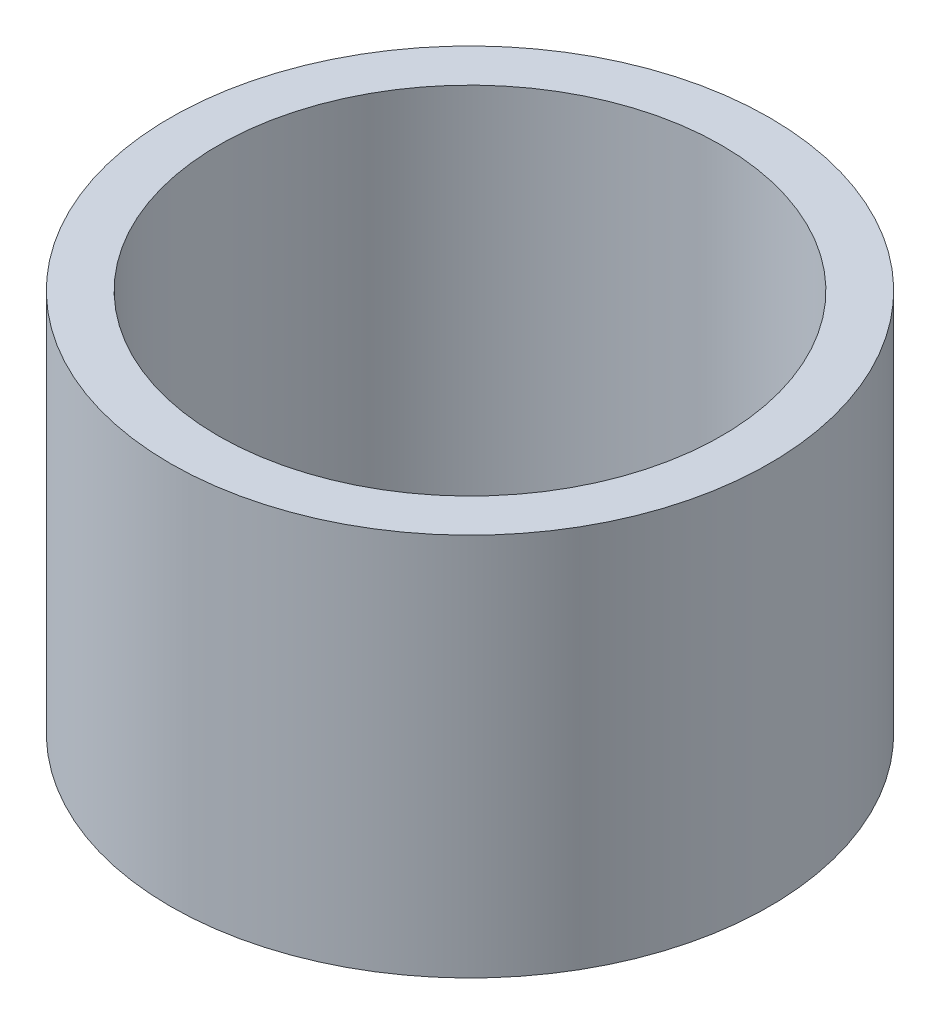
ISO-10303-21;
HEADER;
FILE_DESCRIPTION(('STEP AP214'),'2;1');
FILE_NAME('part.step','',(''),(''),'','','');
FILE_SCHEMA(('AUTOMOTIVE_DESIGN { 1 0 10303 214 1 1 1 1 }'));
ENDSEC;
DATA;
#1=APPLICATION_CONTEXT('core data for automotive mechanical design processes');
#2=APPLICATION_PROTOCOL_DEFINITION('international standard','automotive_design',2000,#1);
#3=PRODUCT_CONTEXT('',#1,'mechanical');
#4=PRODUCT('Part','Part','',(#3));
#5=PRODUCT_RELATED_PRODUCT_CATEGORY('part','',(#4));
#6=PRODUCT_DEFINITION_FORMATION('','',#4);
#7=PRODUCT_DEFINITION_CONTEXT('part definition',#1,'design');
#8=PRODUCT_DEFINITION('design','',#6,#7);
#9=PRODUCT_DEFINITION_SHAPE('','',#8);
#10=(LENGTH_UNIT() NAMED_UNIT(*) SI_UNIT(.MILLI.,.METRE.));
#11=(NAMED_UNIT(*) PLANE_ANGLE_UNIT() SI_UNIT($,.RADIAN.));
#12=(NAMED_UNIT(*) SI_UNIT($,.STERADIAN.) SOLID_ANGLE_UNIT());
#13=UNCERTAINTY_MEASURE_WITH_UNIT(LENGTH_MEASURE(1.E-05),#10,'distance_accuracy_value','');
#14=(GEOMETRIC_REPRESENTATION_CONTEXT(3) GLOBAL_UNCERTAINTY_ASSIGNED_CONTEXT((#13)) GLOBAL_UNIT_ASSIGNED_CONTEXT((#10,
#11,#12)) REPRESENTATION_CONTEXT('',''));
#15=CARTESIAN_POINT('',(0.,0.,0.));
#16=DIRECTION('',(0.,0.,1.));
#17=DIRECTION('',(1.,0.,0.));
#18=AXIS2_PLACEMENT_3D('',#15,#16,#17);
#19=CARTESIAN_POINT('',(0.,10.16,0.));
#20=DIRECTION('',(0.,1.,0.));
#21=DIRECTION('',(0.,0.,1.));
#22=AXIS2_PLACEMENT_3D('',#19,#20,#21);
#23=PLANE('',#22);
#24=CARTESIAN_POINT('',(0.,10.16,0.));
#25=DIRECTION('',(0.,1.,0.));
#26=DIRECTION('',(0.,0.,1.));
#27=AXIS2_PLACEMENT_3D('',#24,#25,#26);
#28=CIRCLE('',#27,7.9375);
#29=CARTESIAN_POINT('',(0.,10.16,7.9375));
#30=VERTEX_POINT('',#29);
#31=EDGE_CURVE('E10',#30,#30,#28,.T.);
#32=ORIENTED_EDGE('',*,*,#31,.T.);
#33=EDGE_LOOP('',(#32));
#34=FACE_BOUND('',#33,.T.);
#35=CARTESIAN_POINT('',(0.,10.16,0.));
#36=DIRECTION('',(0.,1.,0.));
#37=DIRECTION('',(0.,0.,1.));
#38=AXIS2_PLACEMENT_3D('',#35,#36,#37);
#39=CIRCLE('',#38,6.6675);
#40=CARTESIAN_POINT('',(0.,10.16,6.6675));
#41=VERTEX_POINT('',#40);
#42=EDGE_CURVE('E39',#41,#41,#39,.T.);
#43=ORIENTED_EDGE('',*,*,#42,.F.);
#44=EDGE_LOOP('',(#43));
#45=FACE_BOUND('',#44,.T.);
#46=ADVANCED_FACE('F28',(#34,#45),#23,.T.);
#47=CARTESIAN_POINT('',(0.,0.,0.));
#48=DIRECTION('',(0.,1.,0.));
#49=DIRECTION('',(0.,0.,1.));
#50=AXIS2_PLACEMENT_3D('',#47,#48,#49);
#51=PLANE('',#50);
#52=CARTESIAN_POINT('',(0.,0.,0.));
#53=DIRECTION('',(0.,1.,0.));
#54=DIRECTION('',(0.,0.,1.));
#55=AXIS2_PLACEMENT_3D('',#52,#53,#54);
#56=CIRCLE('',#55,7.9375);
#57=CARTESIAN_POINT('',(0.,0.,7.9375));
#58=VERTEX_POINT('',#57);
#59=EDGE_CURVE('E32',#58,#58,#56,.T.);
#60=ORIENTED_EDGE('',*,*,#59,.F.);
#61=EDGE_LOOP('',(#60));
#62=FACE_BOUND('',#61,.T.);
#63=CARTESIAN_POINT('',(0.,0.,0.));
#64=DIRECTION('',(0.,1.,0.));
#65=DIRECTION('',(0.,0.,1.));
#66=AXIS2_PLACEMENT_3D('',#63,#64,#65);
#67=CIRCLE('',#66,6.6675);
#68=CARTESIAN_POINT('',(0.,0.,6.6675));
#69=VERTEX_POINT('',#68);
#70=EDGE_CURVE('E41',#69,#69,#67,.T.);
#71=ORIENTED_EDGE('',*,*,#70,.T.);
#72=EDGE_LOOP('',(#71));
#73=FACE_BOUND('',#72,.T.);
#74=ADVANCED_FACE('F51',(#62,#73),#51,.F.);
#75=CARTESIAN_POINT('',(0.,10.16,0.));
#76=DIRECTION('',(0.,-1.,0.));
#77=DIRECTION('',(0.,0.,-1.));
#78=AXIS2_PLACEMENT_3D('',#75,#76,#77);
#79=CYLINDRICAL_SURFACE('',#78,7.9375);
#80=ORIENTED_EDGE('',*,*,#31,.F.);
#81=EDGE_LOOP('',(#80));
#82=FACE_BOUND('',#81,.T.);
#83=ORIENTED_EDGE('',*,*,#59,.T.);
#84=EDGE_LOOP('',(#83));
#85=FACE_BOUND('',#84,.T.);
#86=ADVANCED_FACE('F30',(#82,#85),#79,.T.);
#87=CARTESIAN_POINT('',(0.,10.16,0.));
#88=DIRECTION('',(0.,-1.,0.));
#89=DIRECTION('',(0.,0.,-1.));
#90=AXIS2_PLACEMENT_3D('',#87,#88,#89);
#91=CYLINDRICAL_SURFACE('',#90,6.6675);
#92=ORIENTED_EDGE('',*,*,#42,.T.);
#93=EDGE_LOOP('',(#92));
#94=FACE_BOUND('',#93,.T.);
#95=ORIENTED_EDGE('',*,*,#70,.F.);
#96=EDGE_LOOP('',(#95));
#97=FACE_BOUND('',#96,.T.);
#98=ADVANCED_FACE('F47',(#94,#97),#91,.F.);
#99=CLOSED_SHELL('',(#46,#74,#86,#98));
#100=MANIFOLD_SOLID_BREP('B2',#99);
#101=ADVANCED_BREP_SHAPE_REPRESENTATION('',(#18,#100),#14);
#102=SHAPE_DEFINITION_REPRESENTATION(#9,#101);
ENDSEC;
END-ISO-10303-21;
